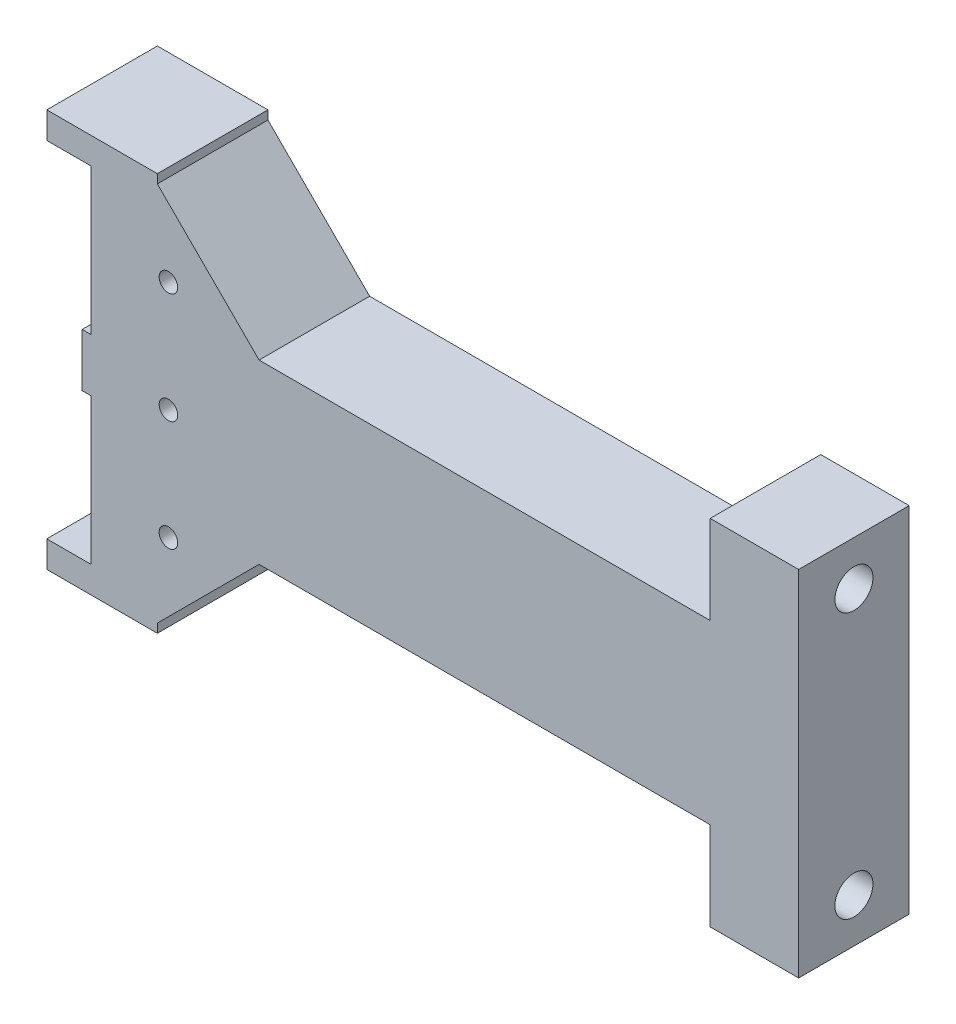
ISO-10303-21;
HEADER;
FILE_DESCRIPTION(('STEP AP214'),'2;1');
FILE_NAME('part.step','',(''),(''),'','','');
FILE_SCHEMA(('AUTOMOTIVE_DESIGN { 1 0 10303 214 1 1 1 1 }'));
ENDSEC;
DATA;
#1=APPLICATION_CONTEXT('core data for automotive mechanical design processes');
#2=APPLICATION_PROTOCOL_DEFINITION('international standard','automotive_design',2000,#1);
#3=PRODUCT_CONTEXT('',#1,'mechanical');
#4=PRODUCT('Part','Part','',(#3));
#5=PRODUCT_RELATED_PRODUCT_CATEGORY('part','',(#4));
#6=PRODUCT_DEFINITION_FORMATION('','',#4);
#7=PRODUCT_DEFINITION_CONTEXT('part definition',#1,'design');
#8=PRODUCT_DEFINITION('design','',#6,#7);
#9=PRODUCT_DEFINITION_SHAPE('','',#8);
#10=(LENGTH_UNIT() NAMED_UNIT(*) SI_UNIT(.MILLI.,.METRE.));
#11=(NAMED_UNIT(*) PLANE_ANGLE_UNIT() SI_UNIT($,.RADIAN.));
#12=(NAMED_UNIT(*) SI_UNIT($,.STERADIAN.) SOLID_ANGLE_UNIT());
#13=UNCERTAINTY_MEASURE_WITH_UNIT(LENGTH_MEASURE(1.E-05),#10,'distance_accuracy_value','');
#14=(GEOMETRIC_REPRESENTATION_CONTEXT(3) GLOBAL_UNCERTAINTY_ASSIGNED_CONTEXT((#13)) GLOBAL_UNIT_ASSIGNED_CONTEXT((#10,
#11,#12)) REPRESENTATION_CONTEXT('',''));
#15=CARTESIAN_POINT('',(0.,0.,0.));
#16=DIRECTION('',(0.,0.,1.));
#17=DIRECTION('',(1.,0.,0.));
#18=AXIS2_PLACEMENT_3D('',#15,#16,#17);
#19=CARTESIAN_POINT('',(-148.,296.054588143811,0.));
#20=DIRECTION('',(1.,0.,0.));
#21=DIRECTION('',(0.,0.,-1.));
#22=AXIS2_PLACEMENT_3D('',#19,#20,#21);
#23=PLANE('',#22);
#24=CARTESIAN_POINT('',(-148.,277.054588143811,19.));
#25=DIRECTION('',(-1.,0.,0.));
#26=DIRECTION('',(0.,0.,1.));
#27=AXIS2_PLACEMENT_3D('',#24,#25,#26);
#28=CIRCLE('',#27,2.1);
#29=CARTESIAN_POINT('',(-148.,277.054588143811,21.1));
#30=VERTEX_POINT('',#29);
#31=EDGE_CURVE('E287',#30,#30,#28,.T.);
#32=ORIENTED_EDGE('',*,*,#31,.F.);
#33=EDGE_LOOP('',(#32));
#34=FACE_BOUND('',#33,.T.);
#35=CARTESIAN_POINT('',(-148.,290.054588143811,19.));
#36=DIRECTION('',(-1.,0.,0.));
#37=DIRECTION('',(0.,0.,1.));
#38=AXIS2_PLACEMENT_3D('',#35,#36,#37);
#39=CIRCLE('',#38,2.1);
#40=CARTESIAN_POINT('',(-148.,290.054588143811,21.1));
#41=VERTEX_POINT('',#40);
#42=EDGE_CURVE('E281',#41,#41,#39,.T.);
#43=ORIENTED_EDGE('',*,*,#42,.F.);
#44=EDGE_LOOP('',(#43));
#45=FACE_BOUND('',#44,.T.);
#46=CARTESIAN_POINT('',(-148.,290.054588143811,5.99999999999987));
#47=DIRECTION('',(-1.,0.,0.));
#48=DIRECTION('',(0.,0.,1.));
#49=AXIS2_PLACEMENT_3D('',#46,#47,#48);
#50=CIRCLE('',#49,2.1);
#51=CARTESIAN_POINT('',(-148.,290.054588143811,8.09999999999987));
#52=VERTEX_POINT('',#51);
#53=EDGE_CURVE('E275',#52,#52,#50,.T.);
#54=ORIENTED_EDGE('',*,*,#53,.F.);
#55=EDGE_LOOP('',(#54));
#56=FACE_BOUND('',#55,.T.);
#57=CARTESIAN_POINT('',(-148.,277.054588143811,5.99999999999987));
#58=DIRECTION('',(-1.,0.,0.));
#59=DIRECTION('',(0.,0.,1.));
#60=AXIS2_PLACEMENT_3D('',#57,#58,#59);
#61=CIRCLE('',#60,2.1);
#62=CARTESIAN_POINT('',(-148.,277.054588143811,8.09999999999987));
#63=VERTEX_POINT('',#62);
#64=EDGE_CURVE('E269',#63,#63,#61,.T.);
#65=ORIENTED_EDGE('',*,*,#64,.F.);
#66=EDGE_LOOP('',(#65));
#67=FACE_BOUND('',#66,.T.);
#68=DIRECTION('',(0.,1.,0.));
#69=VECTOR('',#68,1.);
#70=CARTESIAN_POINT('',(-148.,296.054588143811,0.));
#71=LINE('',#70,#69);
#72=CARTESIAN_POINT('',(-148.,263.054588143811,0.));
#73=VERTEX_POINT('',#72);
#74=CARTESIAN_POINT('',(-148.,296.054588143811,0.));
#75=VERTEX_POINT('',#74);
#76=EDGE_CURVE('E31',#73,#75,#71,.T.);
#77=ORIENTED_EDGE('',*,*,#76,.F.);
#78=DIRECTION('',(0.,0.,1.));
#79=VECTOR('',#78,1.);
#80=CARTESIAN_POINT('',(-148.,263.054588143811,0.));
#81=LINE('',#80,#79);
#82=CARTESIAN_POINT('',(-148.,263.054588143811,25.));
#83=VERTEX_POINT('',#82);
#84=EDGE_CURVE('E225',#73,#83,#81,.T.);
#85=ORIENTED_EDGE('',*,*,#84,.T.);
#86=DIRECTION('',(0.,1.,0.));
#87=VECTOR('',#86,1.);
#88=CARTESIAN_POINT('',(-148.,296.054588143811,25.));
#89=LINE('',#88,#87);
#90=CARTESIAN_POINT('',(-148.,296.054588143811,25.));
#91=VERTEX_POINT('',#90);
#92=EDGE_CURVE('E315',#83,#91,#89,.T.);
#93=ORIENTED_EDGE('',*,*,#92,.T.);
#94=DIRECTION('',(0.,0.,1.));
#95=VECTOR('',#94,1.);
#96=CARTESIAN_POINT('',(-148.,296.054588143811,0.));
#97=LINE('',#96,#95);
#98=EDGE_CURVE('E323',#75,#91,#97,.T.);
#99=ORIENTED_EDGE('',*,*,#98,.F.);
#100=EDGE_LOOP('',(#77,#85,#93,#99));
#101=FACE_BOUND('',#100,.T.);
#102=ADVANCED_FACE('F16',(#34,#45,#56,#67,#101),#23,.F.);
#103=CARTESIAN_POINT('',(-158.,302.054588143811,25.));
#104=DIRECTION('',(1.,0.,0.));
#105=DIRECTION('',(0.,0.,-1.));
#106=AXIS2_PLACEMENT_3D('',#103,#104,#105);
#107=PLANE('',#106);
#108=DIRECTION('',(0.,-1.,0.));
#109=VECTOR('',#108,1.);
#110=CARTESIAN_POINT('',(-158.,302.054588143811,0.));
#111=LINE('',#110,#109);
#112=CARTESIAN_POINT('',(-158.,302.054588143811,0.));
#113=VERTEX_POINT('',#112);
#114=CARTESIAN_POINT('',(-158.,296.054588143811,0.));
#115=VERTEX_POINT('',#114);
#116=EDGE_CURVE('E360',#113,#115,#111,.T.);
#117=ORIENTED_EDGE('',*,*,#116,.T.);
#118=DIRECTION('',(0.,0.,1.));
#119=VECTOR('',#118,1.);
#120=CARTESIAN_POINT('',(-158.,296.054588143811,0.));
#121=LINE('',#120,#119);
#122=CARTESIAN_POINT('',(-158.,296.054588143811,25.));
#123=VERTEX_POINT('',#122);
#124=EDGE_CURVE('E319',#115,#123,#121,.T.);
#125=ORIENTED_EDGE('',*,*,#124,.T.);
#126=DIRECTION('',(0.,-1.,0.));
#127=VECTOR('',#126,1.);
#128=CARTESIAN_POINT('',(-158.,302.054588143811,25.));
#129=LINE('',#128,#127);
#130=CARTESIAN_POINT('',(-158.,302.054588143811,25.));
#131=VERTEX_POINT('',#130);
#132=EDGE_CURVE('E329',#131,#123,#129,.T.);
#133=ORIENTED_EDGE('',*,*,#132,.F.);
#134=DIRECTION('',(0.,0.,-1.));
#135=VECTOR('',#134,1.);
#136=CARTESIAN_POINT('',(-158.,302.054588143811,25.));
#137=LINE('',#136,#135);
#138=EDGE_CURVE('E359',#131,#113,#137,.T.);
#139=ORIENTED_EDGE('',*,*,#138,.T.);
#140=EDGE_LOOP('',(#117,#125,#133,#139));
#141=FACE_BOUND('',#140,.T.);
#142=ADVANCED_FACE('F470',(#141),#107,.F.);
#143=CARTESIAN_POINT('',(-158.,218.05458814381,25.));
#144=VERTEX_POINT('',#143);
#145=CARTESIAN_POINT('',(-158.,212.054588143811,25.));
#146=VERTEX_POINT('',#145);
#147=EDGE_CURVE('E333',#144,#146,#129,.T.);
#148=ORIENTED_EDGE('',*,*,#147,.F.);
#149=DIRECTION('',(0.,0.,1.));
#150=VECTOR('',#149,1.);
#151=CARTESIAN_POINT('',(-158.,218.05458814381,0.));
#152=LINE('',#151,#150);
#153=CARTESIAN_POINT('',(-158.,218.05458814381,0.));
#154=VERTEX_POINT('',#153);
#155=EDGE_CURVE('E312',#154,#144,#152,.T.);
#156=ORIENTED_EDGE('',*,*,#155,.F.);
#157=CARTESIAN_POINT('',(-158.,212.054588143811,0.));
#158=VERTEX_POINT('',#157);
#159=EDGE_CURVE('E322',#154,#158,#111,.T.);
#160=ORIENTED_EDGE('',*,*,#159,.T.);
#161=DIRECTION('',(0.,0.,-1.));
#162=VECTOR('',#161,1.);
#163=CARTESIAN_POINT('',(-158.,212.054588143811,25.));
#164=LINE('',#163,#162);
#165=EDGE_CURVE('E11',#146,#158,#164,.T.);
#166=ORIENTED_EDGE('',*,*,#165,.F.);
#167=EDGE_LOOP('',(#148,#156,#160,#166));
#168=FACE_BOUND('',#167,.T.);
#169=ADVANCED_FACE('F18',(#168),#107,.F.);
#170=CARTESIAN_POINT('',(-133.,212.054588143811,25.));
#171=DIRECTION('',(0.,1.,0.));
#172=DIRECTION('',(0.,0.,1.));
#173=AXIS2_PLACEMENT_3D('',#170,#171,#172);
#174=PLANE('',#173);
#175=DIRECTION('',(1.,0.,0.));
#176=VECTOR('',#175,1.);
#177=CARTESIAN_POINT('',(-133.,212.054588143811,0.));
#178=LINE('',#177,#176);
#179=CARTESIAN_POINT('',(-133.,212.054588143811,0.));
#180=VERTEX_POINT('',#179);
#181=EDGE_CURVE('E363',#158,#180,#178,.T.);
#182=ORIENTED_EDGE('',*,*,#181,.T.);
#183=DIRECTION('',(0.,0.,-1.));
#184=VECTOR('',#183,1.);
#185=CARTESIAN_POINT('',(-133.,212.054588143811,25.));
#186=LINE('',#185,#184);
#187=CARTESIAN_POINT('',(-133.,212.054588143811,25.));
#188=VERTEX_POINT('',#187);
#189=EDGE_CURVE('E24',#188,#180,#186,.T.);
#190=ORIENTED_EDGE('',*,*,#189,.F.);
#191=DIRECTION('',(1.,0.,0.));
#192=VECTOR('',#191,1.);
#193=CARTESIAN_POINT('',(-133.,212.054588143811,25.));
#194=LINE('',#193,#192);
#195=EDGE_CURVE('E332',#146,#188,#194,.T.);
#196=ORIENTED_EDGE('',*,*,#195,.F.);
#197=ORIENTED_EDGE('',*,*,#165,.T.);
#198=EDGE_LOOP('',(#182,#190,#196,#197));
#199=FACE_BOUND('',#198,.T.);
#200=ADVANCED_FACE('F452',(#199),#174,.F.);
#201=CARTESIAN_POINT('',(-133.,214.054588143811,25.));
#202=DIRECTION('',(-1.,0.,0.));
#203=DIRECTION('',(0.,0.,1.));
#204=AXIS2_PLACEMENT_3D('',#201,#202,#203);
#205=PLANE('',#204);
#206=DIRECTION('',(0.,1.,0.));
#207=VECTOR('',#206,1.);
#208=CARTESIAN_POINT('',(-133.,214.054588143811,0.));
#209=LINE('',#208,#207);
#210=CARTESIAN_POINT('',(-133.,214.054588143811,0.));
#211=VERTEX_POINT('',#210);
#212=EDGE_CURVE('E365',#180,#211,#209,.T.);
#213=ORIENTED_EDGE('',*,*,#212,.T.);
#214=DIRECTION('',(0.,0.,-1.));
#215=VECTOR('',#214,1.);
#216=CARTESIAN_POINT('',(-133.,214.054588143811,25.));
#217=LINE('',#216,#215);
#218=CARTESIAN_POINT('',(-133.,214.054588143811,25.));
#219=VERTEX_POINT('',#218);
#220=EDGE_CURVE('E421',#219,#211,#217,.T.);
#221=ORIENTED_EDGE('',*,*,#220,.F.);
#222=DIRECTION('',(0.,1.,0.));
#223=VECTOR('',#222,1.);
#224=CARTESIAN_POINT('',(-133.,214.054588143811,25.));
#225=LINE('',#224,#223);
#226=EDGE_CURVE('E335',#188,#219,#225,.T.);
#227=ORIENTED_EDGE('',*,*,#226,.F.);
#228=ORIENTED_EDGE('',*,*,#189,.T.);
#229=EDGE_LOOP('',(#213,#221,#227,#228));
#230=FACE_BOUND('',#229,.T.);
#231=ADVANCED_FACE('F428',(#230),#205,.F.);
#232=CARTESIAN_POINT('',(-110.,237.05458814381,25.));
#233=DIRECTION('',(-0.707106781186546,0.707106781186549,0.));
#234=DIRECTION('',(-0.707106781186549,-0.707106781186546,0.));
#235=AXIS2_PLACEMENT_3D('',#232,#233,#234);
#236=PLANE('',#235);
#237=DIRECTION('',(0.707106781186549,0.707106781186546,0.));
#238=VECTOR('',#237,1.);
#239=CARTESIAN_POINT('',(-110.,237.05458814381,0.));
#240=LINE('',#239,#238);
#241=CARTESIAN_POINT('',(-110.,237.05458814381,0.));
#242=VERTEX_POINT('',#241);
#243=EDGE_CURVE('E367',#211,#242,#240,.T.);
#244=ORIENTED_EDGE('',*,*,#243,.T.);
#245=DIRECTION('',(0.,0.,-1.));
#246=VECTOR('',#245,1.);
#247=CARTESIAN_POINT('',(-110.,237.05458814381,25.));
#248=LINE('',#247,#246);
#249=CARTESIAN_POINT('',(-110.,237.05458814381,25.));
#250=VERTEX_POINT('',#249);
#251=EDGE_CURVE('E418',#250,#242,#248,.T.);
#252=ORIENTED_EDGE('',*,*,#251,.F.);
#253=DIRECTION('',(0.707106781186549,0.707106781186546,0.));
#254=VECTOR('',#253,1.);
#255=CARTESIAN_POINT('',(-110.,237.05458814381,25.));
#256=LINE('',#255,#254);
#257=EDGE_CURVE('E337',#219,#250,#256,.T.);
#258=ORIENTED_EDGE('',*,*,#257,.F.);
#259=ORIENTED_EDGE('',*,*,#220,.T.);
#260=EDGE_LOOP('',(#244,#252,#258,#259));
#261=FACE_BOUND('',#260,.T.);
#262=ADVANCED_FACE('F439',(#261),#236,.F.);
#263=CARTESIAN_POINT('',(-8.,237.05458814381,25.));
#264=DIRECTION('',(0.,1.,0.));
#265=DIRECTION('',(0.,0.,1.));
#266=AXIS2_PLACEMENT_3D('',#263,#264,#265);
#267=PLANE('',#266);
#268=DIRECTION('',(1.,0.,0.));
#269=VECTOR('',#268,1.);
#270=CARTESIAN_POINT('',(-8.,237.05458814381,0.));
#271=LINE('',#270,#269);
#272=CARTESIAN_POINT('',(-8.,237.05458814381,0.));
#273=VERTEX_POINT('',#272);
#274=EDGE_CURVE('E369',#242,#273,#271,.T.);
#275=ORIENTED_EDGE('',*,*,#274,.T.);
#276=DIRECTION('',(0.,0.,-1.));
#277=VECTOR('',#276,1.);
#278=CARTESIAN_POINT('',(-8.,237.05458814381,25.));
#279=LINE('',#278,#277);
#280=CARTESIAN_POINT('',(-8.,237.05458814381,25.));
#281=VERTEX_POINT('',#280);
#282=EDGE_CURVE('E415',#281,#273,#279,.T.);
#283=ORIENTED_EDGE('',*,*,#282,.F.);
#284=DIRECTION('',(1.,0.,0.));
#285=VECTOR('',#284,1.);
#286=CARTESIAN_POINT('',(-8.,237.05458814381,25.));
#287=LINE('',#286,#285);
#288=EDGE_CURVE('E339',#250,#281,#287,.T.);
#289=ORIENTED_EDGE('',*,*,#288,.F.);
#290=ORIENTED_EDGE('',*,*,#251,.T.);
#291=EDGE_LOOP('',(#275,#283,#289,#290));
#292=FACE_BOUND('',#291,.T.);
#293=ADVANCED_FACE('F443',(#292),#267,.F.);
#294=CARTESIAN_POINT('',(-8.,217.05458814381,25.));
#295=DIRECTION('',(1.,0.,0.));
#296=DIRECTION('',(0.,1.,0.));
#297=AXIS2_PLACEMENT_3D('',#294,#295,#296);
#298=PLANE('',#297);
#299=CARTESIAN_POINT('',(-8.,227.05458814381,12.5));
#300=DIRECTION('',(1.,0.,0.));
#301=DIRECTION('',(0.,0.,-1.));
#302=AXIS2_PLACEMENT_3D('',#299,#300,#301);
#303=CIRCLE('',#302,4.3);
#304=CARTESIAN_POINT('',(-8.,227.05458814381,8.2));
#305=VERTEX_POINT('',#304);
#306=EDGE_CURVE('E302',#305,#305,#303,.T.);
#307=ORIENTED_EDGE('',*,*,#306,.T.);
#308=EDGE_LOOP('',(#307));
#309=FACE_BOUND('',#308,.T.);
#310=DIRECTION('',(0.,-1.,0.));
#311=VECTOR('',#310,1.);
#312=CARTESIAN_POINT('',(-8.,217.05458814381,0.));
#313=LINE('',#312,#311);
#314=CARTESIAN_POINT('',(-8.,217.05458814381,0.));
#315=VERTEX_POINT('',#314);
#316=EDGE_CURVE('E371',#273,#315,#313,.T.);
#317=ORIENTED_EDGE('',*,*,#316,.T.);
#318=DIRECTION('',(0.,0.,-1.));
#319=VECTOR('',#318,1.);
#320=CARTESIAN_POINT('',(-8.,217.05458814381,25.));
#321=LINE('',#320,#319);
#322=CARTESIAN_POINT('',(-8.,217.05458814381,25.));
#323=VERTEX_POINT('',#322);
#324=EDGE_CURVE('E412',#323,#315,#321,.T.);
#325=ORIENTED_EDGE('',*,*,#324,.F.);
#326=DIRECTION('',(0.,-1.,0.));
#327=VECTOR('',#326,1.);
#328=CARTESIAN_POINT('',(-8.,217.05458814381,25.));
#329=LINE('',#328,#327);
#330=EDGE_CURVE('E341',#281,#323,#329,.T.);
#331=ORIENTED_EDGE('',*,*,#330,.F.);
#332=ORIENTED_EDGE('',*,*,#282,.T.);
#333=EDGE_LOOP('',(#317,#325,#331,#332));
#334=FACE_BOUND('',#333,.T.);
#335=ADVANCED_FACE('F512',(#309,#334),#298,.F.);
#336=CARTESIAN_POINT('',(12.,217.05458814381,25.));
#337=DIRECTION('',(0.,1.,0.));
#338=DIRECTION('',(0.,0.,1.));
#339=AXIS2_PLACEMENT_3D('',#336,#337,#338);
#340=PLANE('',#339);
#341=DIRECTION('',(1.,0.,0.));
#342=VECTOR('',#341,1.);
#343=CARTESIAN_POINT('',(12.,217.05458814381,0.));
#344=LINE('',#343,#342);
#345=CARTESIAN_POINT('',(12.,217.05458814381,0.));
#346=VERTEX_POINT('',#345);
#347=EDGE_CURVE('E373',#315,#346,#344,.T.);
#348=ORIENTED_EDGE('',*,*,#347,.T.);
#349=DIRECTION('',(0.,0.,-1.));
#350=VECTOR('',#349,1.);
#351=CARTESIAN_POINT('',(12.,217.05458814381,25.));
#352=LINE('',#351,#350);
#353=CARTESIAN_POINT('',(12.,217.05458814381,25.));
#354=VERTEX_POINT('',#353);
#355=EDGE_CURVE('E409',#354,#346,#352,.T.);
#356=ORIENTED_EDGE('',*,*,#355,.F.);
#357=DIRECTION('',(1.,0.,0.));
#358=VECTOR('',#357,1.);
#359=CARTESIAN_POINT('',(12.,217.05458814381,25.));
#360=LINE('',#359,#358);
#361=EDGE_CURVE('E343',#323,#354,#360,.T.);
#362=ORIENTED_EDGE('',*,*,#361,.F.);
#363=ORIENTED_EDGE('',*,*,#324,.T.);
#364=EDGE_LOOP('',(#348,#356,#362,#363));
#365=FACE_BOUND('',#364,.T.);
#366=ADVANCED_FACE('F509',(#365),#340,.F.);
#367=CARTESIAN_POINT('',(12.,217.05458814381,25.));
#368=DIRECTION('',(-1.,0.,0.));
#369=DIRECTION('',(0.,-1.,0.));
#370=AXIS2_PLACEMENT_3D('',#367,#368,#369);
#371=PLANE('',#370);
#372=CARTESIAN_POINT('',(12.,287.054588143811,12.5));
#373=DIRECTION('',(1.,0.,0.));
#374=DIRECTION('',(0.,0.,-1.));
#375=AXIS2_PLACEMENT_3D('',#372,#373,#374);
#376=CIRCLE('',#375,4.3);
#377=CARTESIAN_POINT('',(12.,287.054588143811,8.2));
#378=VERTEX_POINT('',#377);
#379=EDGE_CURVE('E293',#378,#378,#376,.T.);
#380=ORIENTED_EDGE('',*,*,#379,.F.);
#381=EDGE_LOOP('',(#380));
#382=FACE_BOUND('',#381,.T.);
#383=CARTESIAN_POINT('',(12.,227.05458814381,12.5));
#384=DIRECTION('',(1.,0.,0.));
#385=DIRECTION('',(0.,0.,-1.));
#386=AXIS2_PLACEMENT_3D('',#383,#384,#385);
#387=CIRCLE('',#386,4.3);
#388=CARTESIAN_POINT('',(12.,227.05458814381,8.2));
#389=VERTEX_POINT('',#388);
#390=EDGE_CURVE('E299',#389,#389,#387,.T.);
#391=ORIENTED_EDGE('',*,*,#390,.F.);
#392=EDGE_LOOP('',(#391));
#393=FACE_BOUND('',#392,.T.);
#394=DIRECTION('',(0.,1.,0.));
#395=VECTOR('',#394,1.);
#396=CARTESIAN_POINT('',(12.,217.05458814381,0.));
#397=LINE('',#396,#395);
#398=CARTESIAN_POINT('',(12.,297.054588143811,0.));
#399=VERTEX_POINT('',#398);
#400=EDGE_CURVE('E375',#346,#399,#397,.T.);
#401=ORIENTED_EDGE('',*,*,#400,.T.);
#402=DIRECTION('',(0.,0.,-1.));
#403=VECTOR('',#402,1.);
#404=CARTESIAN_POINT('',(12.,297.054588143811,25.));
#405=LINE('',#404,#403);
#406=CARTESIAN_POINT('',(12.,297.054588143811,25.));
#407=VERTEX_POINT('',#406);
#408=EDGE_CURVE('E406',#407,#399,#405,.T.);
#409=ORIENTED_EDGE('',*,*,#408,.F.);
#410=DIRECTION('',(0.,1.,0.));
#411=VECTOR('',#410,1.);
#412=CARTESIAN_POINT('',(12.,217.05458814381,25.));
#413=LINE('',#412,#411);
#414=EDGE_CURVE('E345',#354,#407,#413,.T.);
#415=ORIENTED_EDGE('',*,*,#414,.F.);
#416=ORIENTED_EDGE('',*,*,#355,.T.);
#417=EDGE_LOOP('',(#401,#409,#415,#416));
#418=FACE_BOUND('',#417,.T.);
#419=ADVANCED_FACE('F505',(#382,#393,#418),#371,.F.);
#420=CARTESIAN_POINT('',(12.,297.054588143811,25.));
#421=DIRECTION('',(0.,-1.,0.));
#422=DIRECTION('',(0.,0.,-1.));
#423=AXIS2_PLACEMENT_3D('',#420,#421,#422);
#424=PLANE('',#423);
#425=DIRECTION('',(-1.,0.,0.));
#426=VECTOR('',#425,1.);
#427=CARTESIAN_POINT('',(12.,297.054588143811,0.));
#428=LINE('',#427,#426);
#429=CARTESIAN_POINT('',(-8.,297.054588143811,0.));
#430=VERTEX_POINT('',#429);
#431=EDGE_CURVE('E377',#399,#430,#428,.T.);
#432=ORIENTED_EDGE('',*,*,#431,.T.);
#433=DIRECTION('',(0.,0.,-1.));
#434=VECTOR('',#433,1.);
#435=CARTESIAN_POINT('',(-8.,297.054588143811,25.));
#436=LINE('',#435,#434);
#437=CARTESIAN_POINT('',(-8.,297.054588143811,25.));
#438=VERTEX_POINT('',#437);
#439=EDGE_CURVE('E403',#438,#430,#436,.T.);
#440=ORIENTED_EDGE('',*,*,#439,.F.);
#441=DIRECTION('',(-1.,0.,0.));
#442=VECTOR('',#441,1.);
#443=CARTESIAN_POINT('',(12.,297.054588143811,25.));
#444=LINE('',#443,#442);
#445=EDGE_CURVE('E347',#407,#438,#444,.T.);
#446=ORIENTED_EDGE('',*,*,#445,.F.);
#447=ORIENTED_EDGE('',*,*,#408,.T.);
#448=EDGE_LOOP('',(#432,#440,#446,#447));
#449=FACE_BOUND('',#448,.T.);
#450=ADVANCED_FACE('F501',(#449),#424,.F.);
#451=CARTESIAN_POINT('',(-8.,297.054588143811,25.));
#452=DIRECTION('',(1.,0.,0.));
#453=DIRECTION('',(0.,1.,0.));
#454=AXIS2_PLACEMENT_3D('',#451,#452,#453);
#455=PLANE('',#454);
#456=CARTESIAN_POINT('',(-8.,287.054588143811,12.5));
#457=DIRECTION('',(1.,0.,0.));
#458=DIRECTION('',(0.,0.,-1.));
#459=AXIS2_PLACEMENT_3D('',#456,#457,#458);
#460=CIRCLE('',#459,4.3);
#461=CARTESIAN_POINT('',(-8.,287.054588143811,8.2));
#462=VERTEX_POINT('',#461);
#463=EDGE_CURVE('E296',#462,#462,#460,.T.);
#464=ORIENTED_EDGE('',*,*,#463,.T.);
#465=EDGE_LOOP('',(#464));
#466=FACE_BOUND('',#465,.T.);
#467=DIRECTION('',(0.,-1.,0.));
#468=VECTOR('',#467,1.);
#469=CARTESIAN_POINT('',(-8.,297.054588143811,0.));
#470=LINE('',#469,#468);
#471=CARTESIAN_POINT('',(-8.,277.054588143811,0.));
#472=VERTEX_POINT('',#471);
#473=EDGE_CURVE('E379',#430,#472,#470,.T.);
#474=ORIENTED_EDGE('',*,*,#473,.T.);
#475=DIRECTION('',(0.,0.,-1.));
#476=VECTOR('',#475,1.);
#477=CARTESIAN_POINT('',(-8.,277.054588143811,25.));
#478=LINE('',#477,#476);
#479=CARTESIAN_POINT('',(-8.,277.054588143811,25.));
#480=VERTEX_POINT('',#479);
#481=EDGE_CURVE('E400',#480,#472,#478,.T.);
#482=ORIENTED_EDGE('',*,*,#481,.F.);
#483=DIRECTION('',(0.,-1.,0.));
#484=VECTOR('',#483,1.);
#485=CARTESIAN_POINT('',(-8.,297.054588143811,25.));
#486=LINE('',#485,#484);
#487=EDGE_CURVE('E349',#438,#480,#486,.T.);
#488=ORIENTED_EDGE('',*,*,#487,.F.);
#489=ORIENTED_EDGE('',*,*,#439,.T.);
#490=EDGE_LOOP('',(#474,#482,#488,#489));
#491=FACE_BOUND('',#490,.T.);
#492=ADVANCED_FACE('F496',(#466,#491),#455,.F.);
#493=CARTESIAN_POINT('',(-8.,277.054588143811,25.));
#494=DIRECTION('',(0.,-1.,0.));
#495=DIRECTION('',(0.,0.,-1.));
#496=AXIS2_PLACEMENT_3D('',#493,#494,#495);
#497=PLANE('',#496);
#498=DIRECTION('',(-1.,0.,0.));
#499=VECTOR('',#498,1.);
#500=CARTESIAN_POINT('',(-8.,277.054588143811,0.));
#501=LINE('',#500,#499);
#502=CARTESIAN_POINT('',(-110.,277.054588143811,0.));
#503=VERTEX_POINT('',#502);
#504=EDGE_CURVE('E381',#472,#503,#501,.T.);
#505=ORIENTED_EDGE('',*,*,#504,.T.);
#506=DIRECTION('',(0.,0.,-1.));
#507=VECTOR('',#506,1.);
#508=CARTESIAN_POINT('',(-110.,277.054588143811,25.));
#509=LINE('',#508,#507);
#510=CARTESIAN_POINT('',(-110.,277.054588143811,25.));
#511=VERTEX_POINT('',#510);
#512=EDGE_CURVE('E397',#511,#503,#509,.T.);
#513=ORIENTED_EDGE('',*,*,#512,.F.);
#514=DIRECTION('',(-1.,0.,0.));
#515=VECTOR('',#514,1.);
#516=CARTESIAN_POINT('',(-8.,277.054588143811,25.));
#517=LINE('',#516,#515);
#518=EDGE_CURVE('E351',#480,#511,#517,.T.);
#519=ORIENTED_EDGE('',*,*,#518,.F.);
#520=ORIENTED_EDGE('',*,*,#481,.T.);
#521=EDGE_LOOP('',(#505,#513,#519,#520));
#522=FACE_BOUND('',#521,.T.);
#523=ADVANCED_FACE('F490',(#522),#497,.F.);
#524=CARTESIAN_POINT('',(-110.,277.054588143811,25.));
#525=DIRECTION('',(-0.707106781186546,-0.707106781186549,0.));
#526=DIRECTION('',(0.707106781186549,-0.707106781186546,0.));
#527=AXIS2_PLACEMENT_3D('',#524,#525,#526);
#528=PLANE('',#527);
#529=DIRECTION('',(-0.707106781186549,0.707106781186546,0.));
#530=VECTOR('',#529,1.);
#531=CARTESIAN_POINT('',(-110.,277.054588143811,0.));
#532=LINE('',#531,#530);
#533=CARTESIAN_POINT('',(-133.,300.054588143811,0.));
#534=VERTEX_POINT('',#533);
#535=EDGE_CURVE('E383',#503,#534,#532,.T.);
#536=ORIENTED_EDGE('',*,*,#535,.T.);
#537=DIRECTION('',(0.,0.,-1.));
#538=VECTOR('',#537,1.);
#539=CARTESIAN_POINT('',(-133.,300.054588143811,25.));
#540=LINE('',#539,#538);
#541=CARTESIAN_POINT('',(-133.,300.054588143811,25.));
#542=VERTEX_POINT('',#541);
#543=EDGE_CURVE('E394',#542,#534,#540,.T.);
#544=ORIENTED_EDGE('',*,*,#543,.F.);
#545=DIRECTION('',(-0.707106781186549,0.707106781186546,0.));
#546=VECTOR('',#545,1.);
#547=CARTESIAN_POINT('',(-110.,277.054588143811,25.));
#548=LINE('',#547,#546);
#549=EDGE_CURVE('E353',#511,#542,#548,.T.);
#550=ORIENTED_EDGE('',*,*,#549,.F.);
#551=ORIENTED_EDGE('',*,*,#512,.T.);
#552=EDGE_LOOP('',(#536,#544,#550,#551));
#553=FACE_BOUND('',#552,.T.);
#554=ADVANCED_FACE('F486',(#553),#528,.F.);
#555=CARTESIAN_POINT('',(-133.,300.054588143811,25.));
#556=DIRECTION('',(-1.,0.,0.));
#557=DIRECTION('',(0.,0.,1.));
#558=AXIS2_PLACEMENT_3D('',#555,#556,#557);
#559=PLANE('',#558);
#560=DIRECTION('',(0.,1.,0.));
#561=VECTOR('',#560,1.);
#562=CARTESIAN_POINT('',(-133.,300.054588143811,0.));
#563=LINE('',#562,#561);
#564=CARTESIAN_POINT('',(-133.,302.054588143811,0.));
#565=VERTEX_POINT('',#564);
#566=EDGE_CURVE('E385',#534,#565,#563,.T.);
#567=ORIENTED_EDGE('',*,*,#566,.T.);
#568=DIRECTION('',(0.,0.,-1.));
#569=VECTOR('',#568,1.);
#570=CARTESIAN_POINT('',(-133.,302.054588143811,25.));
#571=LINE('',#570,#569);
#572=CARTESIAN_POINT('',(-133.,302.054588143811,25.));
#573=VERTEX_POINT('',#572);
#574=EDGE_CURVE('E391',#573,#565,#571,.T.);
#575=ORIENTED_EDGE('',*,*,#574,.F.);
#576=DIRECTION('',(0.,1.,0.));
#577=VECTOR('',#576,1.);
#578=CARTESIAN_POINT('',(-133.,300.054588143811,25.));
#579=LINE('',#578,#577);
#580=EDGE_CURVE('E355',#542,#573,#579,.T.);
#581=ORIENTED_EDGE('',*,*,#580,.F.);
#582=ORIENTED_EDGE('',*,*,#543,.T.);
#583=EDGE_LOOP('',(#567,#575,#581,#582));
#584=FACE_BOUND('',#583,.T.);
#585=ADVANCED_FACE('F482',(#584),#559,.F.);
#586=CARTESIAN_POINT('',(-133.,302.054588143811,25.));
#587=DIRECTION('',(0.,-1.,0.));
#588=DIRECTION('',(0.,0.,-1.));
#589=AXIS2_PLACEMENT_3D('',#586,#587,#588);
#590=PLANE('',#589);
#591=DIRECTION('',(-1.,0.,0.));
#592=VECTOR('',#591,1.);
#593=CARTESIAN_POINT('',(-133.,302.054588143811,0.));
#594=LINE('',#593,#592);
#595=EDGE_CURVE('E387',#565,#113,#594,.T.);
#596=ORIENTED_EDGE('',*,*,#595,.T.);
#597=ORIENTED_EDGE('',*,*,#138,.F.);
#598=DIRECTION('',(-1.,0.,0.));
#599=VECTOR('',#598,1.);
#600=CARTESIAN_POINT('',(-133.,302.054588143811,25.));
#601=LINE('',#600,#599);
#602=EDGE_CURVE('E357',#573,#131,#601,.T.);
#603=ORIENTED_EDGE('',*,*,#602,.F.);
#604=ORIENTED_EDGE('',*,*,#574,.T.);
#605=EDGE_LOOP('',(#596,#597,#603,#604));
#606=FACE_BOUND('',#605,.T.);
#607=ADVANCED_FACE('F476',(#606),#590,.F.);
#608=CARTESIAN_POINT('',(0.,0.,25.));
#609=DIRECTION('',(0.,0.,-1.));
#610=DIRECTION('',(-1.,0.,0.));
#611=AXIS2_PLACEMENT_3D('',#608,#609,#610);
#612=PLANE('',#611);
#613=CARTESIAN_POINT('',(-130.5,282.054588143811,25.));
#614=DIRECTION('',(0.,0.,-1.));
#615=DIRECTION('',(-1.,0.,0.));
#616=AXIS2_PLACEMENT_3D('',#613,#614,#615);
#617=CIRCLE('',#616,2.1);
#618=CARTESIAN_POINT('',(-132.6,282.054588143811,25.));
#619=VERTEX_POINT('',#618);
#620=EDGE_CURVE('E230',#619,#619,#617,.T.);
#621=ORIENTED_EDGE('',*,*,#620,.T.);
#622=EDGE_LOOP('',(#621));
#623=FACE_BOUND('',#622,.T.);
#624=CARTESIAN_POINT('',(-130.5,257.054588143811,25.));
#625=DIRECTION('',(0.,0.,-1.));
#626=DIRECTION('',(-1.,0.,0.));
#627=AXIS2_PLACEMENT_3D('',#624,#625,#626);
#628=CIRCLE('',#627,2.1);
#629=CARTESIAN_POINT('',(-132.6,257.054588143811,25.));
#630=VERTEX_POINT('',#629);
#631=EDGE_CURVE('E236',#630,#630,#628,.T.);
#632=ORIENTED_EDGE('',*,*,#631,.T.);
#633=EDGE_LOOP('',(#632));
#634=FACE_BOUND('',#633,.T.);
#635=CARTESIAN_POINT('',(-130.5,232.05458814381,25.));
#636=DIRECTION('',(0.,0.,-1.));
#637=DIRECTION('',(-1.,0.,0.));
#638=AXIS2_PLACEMENT_3D('',#635,#636,#637);
#639=CIRCLE('',#638,2.1);
#640=CARTESIAN_POINT('',(-132.6,232.05458814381,25.));
#641=VERTEX_POINT('',#640);
#642=EDGE_CURVE('E242',#641,#641,#639,.T.);
#643=ORIENTED_EDGE('',*,*,#642,.T.);
#644=EDGE_LOOP('',(#643));
#645=FACE_BOUND('',#644,.T.);
#646=ORIENTED_EDGE('',*,*,#132,.T.);
#647=DIRECTION('',(-1.,0.,0.));
#648=VECTOR('',#647,1.);
#649=CARTESIAN_POINT('',(-158.,296.054588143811,25.));
#650=LINE('',#649,#648);
#651=EDGE_CURVE('E308',#91,#123,#650,.T.);
#652=ORIENTED_EDGE('',*,*,#651,.F.);
#653=ORIENTED_EDGE('',*,*,#92,.F.);
#654=DIRECTION('',(-1.,0.,0.));
#655=VECTOR('',#654,1.);
#656=CARTESIAN_POINT('',(-150.,263.054588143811,25.));
#657=LINE('',#656,#655);
#658=CARTESIAN_POINT('',(-150.,263.054588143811,25.));
#659=VERTEX_POINT('',#658);
#660=EDGE_CURVE('E214',#83,#659,#657,.T.);
#661=ORIENTED_EDGE('',*,*,#660,.T.);
#662=DIRECTION('',(0.,-1.,0.));
#663=VECTOR('',#662,1.);
#664=CARTESIAN_POINT('',(-150.,263.054588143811,25.));
#665=LINE('',#664,#663);
#666=CARTESIAN_POINT('',(-150.,251.054588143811,25.));
#667=VERTEX_POINT('',#666);
#668=EDGE_CURVE('E220',#659,#667,#665,.T.);
#669=ORIENTED_EDGE('',*,*,#668,.T.);
#670=DIRECTION('',(1.,0.,0.));
#671=VECTOR('',#670,1.);
#672=CARTESIAN_POINT('',(-150.,251.054588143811,25.));
#673=LINE('',#672,#671);
#674=CARTESIAN_POINT('',(-148.,251.054588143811,25.));
#675=VERTEX_POINT('',#674);
#676=EDGE_CURVE('E195',#667,#675,#673,.T.);
#677=ORIENTED_EDGE('',*,*,#676,.T.);
#678=CARTESIAN_POINT('',(-148.,218.05458814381,25.));
#679=VERTEX_POINT('',#678);
#680=EDGE_CURVE('E316',#679,#675,#89,.T.);
#681=ORIENTED_EDGE('',*,*,#680,.F.);
#682=DIRECTION('',(1.,0.,0.));
#683=VECTOR('',#682,1.);
#684=CARTESIAN_POINT('',(-158.,218.05458814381,25.));
#685=LINE('',#684,#683);
#686=EDGE_CURVE('E305',#144,#679,#685,.T.);
#687=ORIENTED_EDGE('',*,*,#686,.F.);
#688=ORIENTED_EDGE('',*,*,#147,.T.);
#689=ORIENTED_EDGE('',*,*,#195,.T.);
#690=ORIENTED_EDGE('',*,*,#226,.T.);
#691=ORIENTED_EDGE('',*,*,#257,.T.);
#692=ORIENTED_EDGE('',*,*,#288,.T.);
#693=ORIENTED_EDGE('',*,*,#330,.T.);
#694=ORIENTED_EDGE('',*,*,#361,.T.);
#695=ORIENTED_EDGE('',*,*,#414,.T.);
#696=ORIENTED_EDGE('',*,*,#445,.T.);
#697=ORIENTED_EDGE('',*,*,#487,.T.);
#698=ORIENTED_EDGE('',*,*,#518,.T.);
#699=ORIENTED_EDGE('',*,*,#549,.T.);
#700=ORIENTED_EDGE('',*,*,#580,.T.);
#701=ORIENTED_EDGE('',*,*,#602,.T.);
#702=EDGE_LOOP('',(#646,#652,#653,#661,#669,#677,#681,#687,#688,#689,#690,#691,#692,#693,#694,
#695,#696,#697,#698,#699,#700,#701));
#703=FACE_BOUND('',#702,.T.);
#704=ADVANCED_FACE('F447',(#623,#634,#645,#703),#612,.F.);
#705=CARTESIAN_POINT('',(0.,0.,0.));
#706=DIRECTION('',(0.,0.,-1.));
#707=DIRECTION('',(-1.,0.,0.));
#708=AXIS2_PLACEMENT_3D('',#705,#706,#707);
#709=PLANE('',#708);
#710=CARTESIAN_POINT('',(-130.5,282.054588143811,0.));
#711=DIRECTION('',(0.,0.,-1.));
#712=DIRECTION('',(-1.,0.,0.));
#713=AXIS2_PLACEMENT_3D('',#710,#711,#712);
#714=CIRCLE('',#713,2.1);
#715=CARTESIAN_POINT('',(-132.6,282.054588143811,0.));
#716=VERTEX_POINT('',#715);
#717=EDGE_CURVE('E224',#716,#716,#714,.T.);
#718=ORIENTED_EDGE('',*,*,#717,.F.);
#719=EDGE_LOOP('',(#718));
#720=FACE_BOUND('',#719,.T.);
#721=CARTESIAN_POINT('',(-130.5,257.054588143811,0.));
#722=DIRECTION('',(0.,0.,-1.));
#723=DIRECTION('',(-1.,0.,0.));
#724=AXIS2_PLACEMENT_3D('',#721,#722,#723);
#725=CIRCLE('',#724,2.1);
#726=CARTESIAN_POINT('',(-132.6,257.054588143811,0.));
#727=VERTEX_POINT('',#726);
#728=EDGE_CURVE('E233',#727,#727,#725,.T.);
#729=ORIENTED_EDGE('',*,*,#728,.F.);
#730=EDGE_LOOP('',(#729));
#731=FACE_BOUND('',#730,.T.);
#732=CARTESIAN_POINT('',(-130.5,232.05458814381,0.));
#733=DIRECTION('',(0.,0.,-1.));
#734=DIRECTION('',(-1.,0.,0.));
#735=AXIS2_PLACEMENT_3D('',#732,#733,#734);
#736=CIRCLE('',#735,2.1);
#737=CARTESIAN_POINT('',(-132.6,232.05458814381,0.));
#738=VERTEX_POINT('',#737);
#739=EDGE_CURVE('E239',#738,#738,#736,.T.);
#740=ORIENTED_EDGE('',*,*,#739,.F.);
#741=EDGE_LOOP('',(#740));
#742=FACE_BOUND('',#741,.T.);
#743=DIRECTION('',(-1.,0.,0.));
#744=VECTOR('',#743,1.);
#745=CARTESIAN_POINT('',(-158.,296.054588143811,0.));
#746=LINE('',#745,#744);
#747=EDGE_CURVE('E310',#75,#115,#746,.T.);
#748=ORIENTED_EDGE('',*,*,#747,.T.);
#749=ORIENTED_EDGE('',*,*,#116,.F.);
#750=ORIENTED_EDGE('',*,*,#595,.F.);
#751=ORIENTED_EDGE('',*,*,#566,.F.);
#752=ORIENTED_EDGE('',*,*,#535,.F.);
#753=ORIENTED_EDGE('',*,*,#504,.F.);
#754=ORIENTED_EDGE('',*,*,#473,.F.);
#755=ORIENTED_EDGE('',*,*,#431,.F.);
#756=ORIENTED_EDGE('',*,*,#400,.F.);
#757=ORIENTED_EDGE('',*,*,#347,.F.);
#758=ORIENTED_EDGE('',*,*,#316,.F.);
#759=ORIENTED_EDGE('',*,*,#274,.F.);
#760=ORIENTED_EDGE('',*,*,#243,.F.);
#761=ORIENTED_EDGE('',*,*,#212,.F.);
#762=ORIENTED_EDGE('',*,*,#181,.F.);
#763=ORIENTED_EDGE('',*,*,#159,.F.);
#764=DIRECTION('',(1.,0.,0.));
#765=VECTOR('',#764,1.);
#766=CARTESIAN_POINT('',(-158.,218.05458814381,0.));
#767=LINE('',#766,#765);
#768=CARTESIAN_POINT('',(-148.,218.05458814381,0.));
#769=VERTEX_POINT('',#768);
#770=EDGE_CURVE('E306',#154,#769,#767,.T.);
#771=ORIENTED_EDGE('',*,*,#770,.T.);
#772=CARTESIAN_POINT('',(-148.,251.054588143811,0.));
#773=VERTEX_POINT('',#772);
#774=EDGE_CURVE('E210',#769,#773,#71,.T.);
#775=ORIENTED_EDGE('',*,*,#774,.T.);
#776=DIRECTION('',(1.,0.,0.));
#777=VECTOR('',#776,1.);
#778=CARTESIAN_POINT('',(-150.,251.054588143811,0.));
#779=LINE('',#778,#777);
#780=CARTESIAN_POINT('',(-150.,251.054588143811,0.));
#781=VERTEX_POINT('',#780);
#782=EDGE_CURVE('E193',#781,#773,#779,.T.);
#783=ORIENTED_EDGE('',*,*,#782,.F.);
#784=DIRECTION('',(0.,-1.,0.));
#785=VECTOR('',#784,1.);
#786=CARTESIAN_POINT('',(-150.,263.054588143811,0.));
#787=LINE('',#786,#785);
#788=CARTESIAN_POINT('',(-150.,263.054588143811,0.));
#789=VERTEX_POINT('',#788);
#790=EDGE_CURVE('E207',#789,#781,#787,.T.);
#791=ORIENTED_EDGE('',*,*,#790,.F.);
#792=DIRECTION('',(-1.,0.,0.));
#793=VECTOR('',#792,1.);
#794=CARTESIAN_POINT('',(-150.,263.054588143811,0.));
#795=LINE('',#794,#793);
#796=EDGE_CURVE('E200',#73,#789,#795,.T.);
#797=ORIENTED_EDGE('',*,*,#796,.F.);
#798=ORIENTED_EDGE('',*,*,#76,.T.);
#799=EDGE_LOOP('',(#748,#749,#750,#751,#752,#753,#754,#755,#756,#757,#758,#759,#760,#761,#762,
#763,#771,#775,#783,#791,#797,#798));
#800=FACE_BOUND('',#799,.T.);
#801=ADVANCED_FACE('F205',(#720,#731,#742,#800),#709,.T.);
#802=CARTESIAN_POINT('',(-158.,296.054588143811,0.));
#803=DIRECTION('',(0.,1.,0.));
#804=DIRECTION('',(0.,0.,1.));
#805=AXIS2_PLACEMENT_3D('',#802,#803,#804);
#806=PLANE('',#805);
#807=ORIENTED_EDGE('',*,*,#651,.T.);
#808=ORIENTED_EDGE('',*,*,#124,.F.);
#809=ORIENTED_EDGE('',*,*,#747,.F.);
#810=ORIENTED_EDGE('',*,*,#98,.T.);
#811=EDGE_LOOP('',(#807,#808,#809,#810));
#812=FACE_BOUND('',#811,.T.);
#813=ADVANCED_FACE('F467',(#812),#806,.F.);
#814=CARTESIAN_POINT('',(-148.,224.05458814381,6.));
#815=DIRECTION('',(-1.,0.,0.));
#816=DIRECTION('',(0.,0.,1.));
#817=AXIS2_PLACEMENT_3D('',#814,#815,#816);
#818=CIRCLE('',#817,2.1);
#819=CARTESIAN_POINT('',(-148.,224.05458814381,8.1));
#820=VERTEX_POINT('',#819);
#821=EDGE_CURVE('E245',#820,#820,#818,.T.);
#822=ORIENTED_EDGE('',*,*,#821,.F.);
#823=EDGE_LOOP('',(#822));
#824=FACE_BOUND('',#823,.T.);
#825=CARTESIAN_POINT('',(-148.,237.05458814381,19.));
#826=DIRECTION('',(-1.,0.,0.));
#827=DIRECTION('',(0.,0.,1.));
#828=AXIS2_PLACEMENT_3D('',#825,#826,#827);
#829=CIRCLE('',#828,2.1);
#830=CARTESIAN_POINT('',(-148.,237.05458814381,21.1));
#831=VERTEX_POINT('',#830);
#832=EDGE_CURVE('E251',#831,#831,#829,.T.);
#833=ORIENTED_EDGE('',*,*,#832,.F.);
#834=EDGE_LOOP('',(#833));
#835=FACE_BOUND('',#834,.T.);
#836=CARTESIAN_POINT('',(-148.,224.05458814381,19.));
#837=DIRECTION('',(-1.,0.,0.));
#838=DIRECTION('',(0.,0.,1.));
#839=AXIS2_PLACEMENT_3D('',#836,#837,#838);
#840=CIRCLE('',#839,2.1);
#841=CARTESIAN_POINT('',(-148.,224.05458814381,21.1));
#842=VERTEX_POINT('',#841);
#843=EDGE_CURVE('E257',#842,#842,#840,.T.);
#844=ORIENTED_EDGE('',*,*,#843,.F.);
#845=EDGE_LOOP('',(#844));
#846=FACE_BOUND('',#845,.T.);
#847=CARTESIAN_POINT('',(-148.,237.05458814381,6.));
#848=DIRECTION('',(-1.,0.,0.));
#849=DIRECTION('',(0.,0.,1.));
#850=AXIS2_PLACEMENT_3D('',#847,#848,#849);
#851=CIRCLE('',#850,2.1);
#852=CARTESIAN_POINT('',(-148.,237.05458814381,8.1));
#853=VERTEX_POINT('',#852);
#854=EDGE_CURVE('E263',#853,#853,#851,.T.);
#855=ORIENTED_EDGE('',*,*,#854,.F.);
#856=EDGE_LOOP('',(#855));
#857=FACE_BOUND('',#856,.T.);
#858=ORIENTED_EDGE('',*,*,#680,.T.);
#859=DIRECTION('',(0.,0.,1.));
#860=VECTOR('',#859,1.);
#861=CARTESIAN_POINT('',(-148.,251.054588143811,0.));
#862=LINE('',#861,#860);
#863=EDGE_CURVE('E39',#773,#675,#862,.T.);
#864=ORIENTED_EDGE('',*,*,#863,.F.);
#865=ORIENTED_EDGE('',*,*,#774,.F.);
#866=DIRECTION('',(0.,0.,1.));
#867=VECTOR('',#866,1.);
#868=CARTESIAN_POINT('',(-148.,218.05458814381,0.));
#869=LINE('',#868,#867);
#870=EDGE_CURVE('E326',#769,#679,#869,.T.);
#871=ORIENTED_EDGE('',*,*,#870,.T.);
#872=EDGE_LOOP('',(#858,#864,#865,#871));
#873=FACE_BOUND('',#872,.T.);
#874=ADVANCED_FACE('F459',(#824,#835,#846,#857,#873),#23,.F.);
#875=CARTESIAN_POINT('',(-158.,218.05458814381,0.));
#876=DIRECTION('',(0.,-1.,0.));
#877=DIRECTION('',(0.,0.,-1.));
#878=AXIS2_PLACEMENT_3D('',#875,#876,#877);
#879=PLANE('',#878);
#880=ORIENTED_EDGE('',*,*,#686,.T.);
#881=ORIENTED_EDGE('',*,*,#870,.F.);
#882=ORIENTED_EDGE('',*,*,#770,.F.);
#883=ORIENTED_EDGE('',*,*,#155,.T.);
#884=EDGE_LOOP('',(#880,#881,#882,#883));
#885=FACE_BOUND('',#884,.T.);
#886=ADVANCED_FACE('F457',(#885),#879,.F.);
#887=CARTESIAN_POINT('',(12.,227.05458814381,12.5));
#888=DIRECTION('',(1.,0.,0.));
#889=DIRECTION('',(0.,0.,-1.));
#890=AXIS2_PLACEMENT_3D('',#887,#888,#889);
#891=CYLINDRICAL_SURFACE('',#890,4.3);
#892=ORIENTED_EDGE('',*,*,#306,.F.);
#893=EDGE_LOOP('',(#892));
#894=FACE_BOUND('',#893,.T.);
#895=ORIENTED_EDGE('',*,*,#390,.T.);
#896=EDGE_LOOP('',(#895));
#897=FACE_BOUND('',#896,.T.);
#898=ADVANCED_FACE('F542',(#894,#897),#891,.F.);
#899=CARTESIAN_POINT('',(12.,287.054588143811,12.5));
#900=DIRECTION('',(1.,0.,0.));
#901=DIRECTION('',(0.,0.,-1.));
#902=AXIS2_PLACEMENT_3D('',#899,#900,#901);
#903=CYLINDRICAL_SURFACE('',#902,4.3);
#904=ORIENTED_EDGE('',*,*,#463,.F.);
#905=EDGE_LOOP('',(#904));
#906=FACE_BOUND('',#905,.T.);
#907=ORIENTED_EDGE('',*,*,#379,.T.);
#908=EDGE_LOOP('',(#907));
#909=FACE_BOUND('',#908,.T.);
#910=ADVANCED_FACE('F601',(#906,#909),#903,.F.);
#911=CARTESIAN_POINT('',(-132.,277.054588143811,19.));
#912=DIRECTION('',(-1.,0.,0.));
#913=DIRECTION('',(0.,0.,1.));
#914=AXIS2_PLACEMENT_3D('',#911,#912,#913);
#915=CONICAL_SURFACE('',#914,2.1,1.02974425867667);
#916=CARTESIAN_POINT('',(-130.738192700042,277.054588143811,19.));
#917=VERTEX_POINT('',#916);
#918=VERTEX_LOOP('',#917);
#919=FACE_BOUND('',#918,.T.);
#920=CARTESIAN_POINT('',(-132.,277.054588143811,19.));
#921=DIRECTION('',(-1.,0.,0.));
#922=DIRECTION('',(0.,0.,1.));
#923=AXIS2_PLACEMENT_3D('',#920,#921,#922);
#924=CIRCLE('',#923,2.1);
#925=CARTESIAN_POINT('',(-132.,277.054588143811,21.1));
#926=VERTEX_POINT('',#925);
#927=EDGE_CURVE('E290',#926,#926,#924,.T.);
#928=ORIENTED_EDGE('',*,*,#927,.T.);
#929=EDGE_LOOP('',(#928));
#930=FACE_BOUND('',#929,.T.);
#931=ADVANCED_FACE('F597',(#919,#930),#915,.F.);
#932=CARTESIAN_POINT('',(-148.,277.054588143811,19.));
#933=DIRECTION('',(-1.,0.,0.));
#934=DIRECTION('',(0.,0.,1.));
#935=AXIS2_PLACEMENT_3D('',#932,#933,#934);
#936=CYLINDRICAL_SURFACE('',#935,2.1);
#937=ORIENTED_EDGE('',*,*,#927,.F.);
#938=EDGE_LOOP('',(#937));
#939=FACE_BOUND('',#938,.T.);
#940=ORIENTED_EDGE('',*,*,#31,.T.);
#941=EDGE_LOOP('',(#940));
#942=FACE_BOUND('',#941,.T.);
#943=ADVANCED_FACE('F593',(#939,#942),#936,.F.);
#944=CARTESIAN_POINT('',(-132.,290.054588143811,19.));
#945=DIRECTION('',(-1.,0.,0.));
#946=DIRECTION('',(0.,0.,1.));
#947=AXIS2_PLACEMENT_3D('',#944,#945,#946);
#948=CONICAL_SURFACE('',#947,2.1,1.02974425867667);
#949=CARTESIAN_POINT('',(-130.738192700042,290.054588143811,19.));
#950=VERTEX_POINT('',#949);
#951=VERTEX_LOOP('',#950);
#952=FACE_BOUND('',#951,.T.);
#953=CARTESIAN_POINT('',(-132.,290.054588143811,19.));
#954=DIRECTION('',(-1.,0.,0.));
#955=DIRECTION('',(0.,0.,1.));
#956=AXIS2_PLACEMENT_3D('',#953,#954,#955);
#957=CIRCLE('',#956,2.1);
#958=CARTESIAN_POINT('',(-132.,290.054588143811,21.1));
#959=VERTEX_POINT('',#958);
#960=EDGE_CURVE('E284',#959,#959,#957,.T.);
#961=ORIENTED_EDGE('',*,*,#960,.T.);
#962=EDGE_LOOP('',(#961));
#963=FACE_BOUND('',#962,.T.);
#964=ADVANCED_FACE('F589',(#952,#963),#948,.F.);
#965=CARTESIAN_POINT('',(-148.,290.054588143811,19.));
#966=DIRECTION('',(-1.,0.,0.));
#967=DIRECTION('',(0.,0.,1.));
#968=AXIS2_PLACEMENT_3D('',#965,#966,#967);
#969=CYLINDRICAL_SURFACE('',#968,2.1);
#970=ORIENTED_EDGE('',*,*,#960,.F.);
#971=EDGE_LOOP('',(#970));
#972=FACE_BOUND('',#971,.T.);
#973=ORIENTED_EDGE('',*,*,#42,.T.);
#974=EDGE_LOOP('',(#973));
#975=FACE_BOUND('',#974,.T.);
#976=ADVANCED_FACE('F585',(#972,#975),#969,.F.);
#977=CARTESIAN_POINT('',(-132.,290.054588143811,5.99999999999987));
#978=DIRECTION('',(-1.,0.,0.));
#979=DIRECTION('',(0.,0.,1.));
#980=AXIS2_PLACEMENT_3D('',#977,#978,#979);
#981=CONICAL_SURFACE('',#980,2.1,1.02974425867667);
#982=CARTESIAN_POINT('',(-130.738192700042,290.054588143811,5.99999999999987));
#983=VERTEX_POINT('',#982);
#984=VERTEX_LOOP('',#983);
#985=FACE_BOUND('',#984,.T.);
#986=CARTESIAN_POINT('',(-132.,290.054588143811,5.99999999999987));
#987=DIRECTION('',(-1.,0.,0.));
#988=DIRECTION('',(0.,0.,1.));
#989=AXIS2_PLACEMENT_3D('',#986,#987,#988);
#990=CIRCLE('',#989,2.1);
#991=CARTESIAN_POINT('',(-132.,290.054588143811,8.09999999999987));
#992=VERTEX_POINT('',#991);
#993=EDGE_CURVE('E278',#992,#992,#990,.T.);
#994=ORIENTED_EDGE('',*,*,#993,.T.);
#995=EDGE_LOOP('',(#994));
#996=FACE_BOUND('',#995,.T.);
#997=ADVANCED_FACE('F581',(#985,#996),#981,.F.);
#998=CARTESIAN_POINT('',(-148.,290.054588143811,5.99999999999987));
#999=DIRECTION('',(-1.,0.,0.));
#1000=DIRECTION('',(0.,0.,1.));
#1001=AXIS2_PLACEMENT_3D('',#998,#999,#1000);
#1002=CYLINDRICAL_SURFACE('',#1001,2.1);
#1003=ORIENTED_EDGE('',*,*,#993,.F.);
#1004=EDGE_LOOP('',(#1003));
#1005=FACE_BOUND('',#1004,.T.);
#1006=ORIENTED_EDGE('',*,*,#53,.T.);
#1007=EDGE_LOOP('',(#1006));
#1008=FACE_BOUND('',#1007,.T.);
#1009=ADVANCED_FACE('F577',(#1005,#1008),#1002,.F.);
#1010=CARTESIAN_POINT('',(-132.,277.054588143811,5.99999999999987));
#1011=DIRECTION('',(-1.,0.,0.));
#1012=DIRECTION('',(0.,0.,1.));
#1013=AXIS2_PLACEMENT_3D('',#1010,#1011,#1012);
#1014=CONICAL_SURFACE('',#1013,2.1,1.02974425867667);
#1015=CARTESIAN_POINT('',(-130.738192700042,277.054588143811,5.99999999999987));
#1016=VERTEX_POINT('',#1015);
#1017=VERTEX_LOOP('',#1016);
#1018=FACE_BOUND('',#1017,.T.);
#1019=CARTESIAN_POINT('',(-132.,277.054588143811,5.99999999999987));
#1020=DIRECTION('',(-1.,0.,0.));
#1021=DIRECTION('',(0.,0.,1.));
#1022=AXIS2_PLACEMENT_3D('',#1019,#1020,#1021);
#1023=CIRCLE('',#1022,2.1);
#1024=CARTESIAN_POINT('',(-132.,277.054588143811,8.09999999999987));
#1025=VERTEX_POINT('',#1024);
#1026=EDGE_CURVE('E272',#1025,#1025,#1023,.T.);
#1027=ORIENTED_EDGE('',*,*,#1026,.T.);
#1028=EDGE_LOOP('',(#1027));
#1029=FACE_BOUND('',#1028,.T.);
#1030=ADVANCED_FACE('F573',(#1018,#1029),#1014,.F.);
#1031=CARTESIAN_POINT('',(-148.,277.054588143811,5.99999999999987));
#1032=DIRECTION('',(-1.,0.,0.));
#1033=DIRECTION('',(0.,0.,1.));
#1034=AXIS2_PLACEMENT_3D('',#1031,#1032,#1033);
#1035=CYLINDRICAL_SURFACE('',#1034,2.1);
#1036=ORIENTED_EDGE('',*,*,#1026,.F.);
#1037=EDGE_LOOP('',(#1036));
#1038=FACE_BOUND('',#1037,.T.);
#1039=ORIENTED_EDGE('',*,*,#64,.T.);
#1040=EDGE_LOOP('',(#1039));
#1041=FACE_BOUND('',#1040,.T.);
#1042=ADVANCED_FACE('F565',(#1038,#1041),#1035,.F.);
#1043=CARTESIAN_POINT('',(-132.,237.05458814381,6.));
#1044=DIRECTION('',(-1.,0.,0.));
#1045=DIRECTION('',(0.,0.,1.));
#1046=AXIS2_PLACEMENT_3D('',#1043,#1044,#1045);
#1047=CONICAL_SURFACE('',#1046,2.1,1.02974425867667);
#1048=CARTESIAN_POINT('',(-130.738192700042,237.05458814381,6.));
#1049=VERTEX_POINT('',#1048);
#1050=VERTEX_LOOP('',#1049);
#1051=FACE_BOUND('',#1050,.T.);
#1052=CARTESIAN_POINT('',(-132.,237.05458814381,6.));
#1053=DIRECTION('',(-1.,0.,0.));
#1054=DIRECTION('',(0.,0.,1.));
#1055=AXIS2_PLACEMENT_3D('',#1052,#1053,#1054);
#1056=CIRCLE('',#1055,2.1);
#1057=CARTESIAN_POINT('',(-132.,237.05458814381,8.1));
#1058=VERTEX_POINT('',#1057);
#1059=EDGE_CURVE('E266',#1058,#1058,#1056,.T.);
#1060=ORIENTED_EDGE('',*,*,#1059,.T.);
#1061=EDGE_LOOP('',(#1060));
#1062=FACE_BOUND('',#1061,.T.);
#1063=ADVANCED_FACE('F554',(#1051,#1062),#1047,.F.);
#1064=CARTESIAN_POINT('',(-148.,237.05458814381,6.));
#1065=DIRECTION('',(-1.,0.,0.));
#1066=DIRECTION('',(0.,0.,1.));
#1067=AXIS2_PLACEMENT_3D('',#1064,#1065,#1066);
#1068=CYLINDRICAL_SURFACE('',#1067,2.1);
#1069=ORIENTED_EDGE('',*,*,#1059,.F.);
#1070=EDGE_LOOP('',(#1069));
#1071=FACE_BOUND('',#1070,.T.);
#1072=ORIENTED_EDGE('',*,*,#854,.T.);
#1073=EDGE_LOOP('',(#1072));
#1074=FACE_BOUND('',#1073,.T.);
#1075=ADVANCED_FACE('F551',(#1071,#1074),#1068,.F.);
#1076=CARTESIAN_POINT('',(-132.,224.05458814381,19.));
#1077=DIRECTION('',(-1.,0.,0.));
#1078=DIRECTION('',(0.,0.,1.));
#1079=AXIS2_PLACEMENT_3D('',#1076,#1077,#1078);
#1080=CONICAL_SURFACE('',#1079,2.1,1.02974425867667);
#1081=CARTESIAN_POINT('',(-130.738192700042,224.05458814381,19.));
#1082=VERTEX_POINT('',#1081);
#1083=VERTEX_LOOP('',#1082);
#1084=FACE_BOUND('',#1083,.T.);
#1085=CARTESIAN_POINT('',(-132.,224.05458814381,19.));
#1086=DIRECTION('',(-1.,0.,0.));
#1087=DIRECTION('',(0.,0.,1.));
#1088=AXIS2_PLACEMENT_3D('',#1085,#1086,#1087);
#1089=CIRCLE('',#1088,2.1);
#1090=CARTESIAN_POINT('',(-132.,224.05458814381,21.1));
#1091=VERTEX_POINT('',#1090);
#1092=EDGE_CURVE('E260',#1091,#1091,#1089,.T.);
#1093=ORIENTED_EDGE('',*,*,#1092,.T.);
#1094=EDGE_LOOP('',(#1093));
#1095=FACE_BOUND('',#1094,.T.);
#1096=ADVANCED_FACE('F553',(#1084,#1095),#1080,.F.);
#1097=CARTESIAN_POINT('',(-148.,224.05458814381,19.));
#1098=DIRECTION('',(-1.,0.,0.));
#1099=DIRECTION('',(0.,0.,1.));
#1100=AXIS2_PLACEMENT_3D('',#1097,#1098,#1099);
#1101=CYLINDRICAL_SURFACE('',#1100,2.1);
#1102=ORIENTED_EDGE('',*,*,#1092,.F.);
#1103=EDGE_LOOP('',(#1102));
#1104=FACE_BOUND('',#1103,.T.);
#1105=ORIENTED_EDGE('',*,*,#843,.T.);
#1106=EDGE_LOOP('',(#1105));
#1107=FACE_BOUND('',#1106,.T.);
#1108=ADVANCED_FACE('F562',(#1104,#1107),#1101,.F.);
#1109=CARTESIAN_POINT('',(-132.,237.05458814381,19.));
#1110=DIRECTION('',(-1.,0.,0.));
#1111=DIRECTION('',(0.,0.,1.));
#1112=AXIS2_PLACEMENT_3D('',#1109,#1110,#1111);
#1113=CONICAL_SURFACE('',#1112,2.1,1.02974425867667);
#1114=CARTESIAN_POINT('',(-130.738192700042,237.05458814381,19.));
#1115=VERTEX_POINT('',#1114);
#1116=VERTEX_LOOP('',#1115);
#1117=FACE_BOUND('',#1116,.T.);
#1118=CARTESIAN_POINT('',(-132.,237.05458814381,19.));
#1119=DIRECTION('',(-1.,0.,0.));
#1120=DIRECTION('',(0.,0.,1.));
#1121=AXIS2_PLACEMENT_3D('',#1118,#1119,#1120);
#1122=CIRCLE('',#1121,2.1);
#1123=CARTESIAN_POINT('',(-132.,237.05458814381,21.1));
#1124=VERTEX_POINT('',#1123);
#1125=EDGE_CURVE('E254',#1124,#1124,#1122,.T.);
#1126=ORIENTED_EDGE('',*,*,#1125,.T.);
#1127=EDGE_LOOP('',(#1126));
#1128=FACE_BOUND('',#1127,.T.);
#1129=ADVANCED_FACE('F677',(#1117,#1128),#1113,.F.);
#1130=CARTESIAN_POINT('',(-148.,237.05458814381,19.));
#1131=DIRECTION('',(-1.,0.,0.));
#1132=DIRECTION('',(0.,0.,1.));
#1133=AXIS2_PLACEMENT_3D('',#1130,#1131,#1132);
#1134=CYLINDRICAL_SURFACE('',#1133,2.1);
#1135=ORIENTED_EDGE('',*,*,#1125,.F.);
#1136=EDGE_LOOP('',(#1135));
#1137=FACE_BOUND('',#1136,.T.);
#1138=ORIENTED_EDGE('',*,*,#832,.T.);
#1139=EDGE_LOOP('',(#1138));
#1140=FACE_BOUND('',#1139,.T.);
#1141=ADVANCED_FACE('F673',(#1137,#1140),#1134,.F.);
#1142=CARTESIAN_POINT('',(-132.,224.05458814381,6.));
#1143=DIRECTION('',(-1.,0.,0.));
#1144=DIRECTION('',(0.,0.,1.));
#1145=AXIS2_PLACEMENT_3D('',#1142,#1143,#1144);
#1146=CONICAL_SURFACE('',#1145,2.1,1.02974425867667);
#1147=CARTESIAN_POINT('',(-130.738192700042,224.05458814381,6.));
#1148=VERTEX_POINT('',#1147);
#1149=VERTEX_LOOP('',#1148);
#1150=FACE_BOUND('',#1149,.T.);
#1151=CARTESIAN_POINT('',(-132.,224.05458814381,6.));
#1152=DIRECTION('',(-1.,0.,0.));
#1153=DIRECTION('',(0.,0.,1.));
#1154=AXIS2_PLACEMENT_3D('',#1151,#1152,#1153);
#1155=CIRCLE('',#1154,2.1);
#1156=CARTESIAN_POINT('',(-132.,224.05458814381,8.1));
#1157=VERTEX_POINT('',#1156);
#1158=EDGE_CURVE('E248',#1157,#1157,#1155,.T.);
#1159=ORIENTED_EDGE('',*,*,#1158,.T.);
#1160=EDGE_LOOP('',(#1159));
#1161=FACE_BOUND('',#1160,.T.);
#1162=ADVANCED_FACE('F666',(#1150,#1161),#1146,.F.);
#1163=CARTESIAN_POINT('',(-148.,224.05458814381,6.));
#1164=DIRECTION('',(-1.,0.,0.));
#1165=DIRECTION('',(0.,0.,1.));
#1166=AXIS2_PLACEMENT_3D('',#1163,#1164,#1165);
#1167=CYLINDRICAL_SURFACE('',#1166,2.1);
#1168=ORIENTED_EDGE('',*,*,#1158,.F.);
#1169=EDGE_LOOP('',(#1168));
#1170=FACE_BOUND('',#1169,.T.);
#1171=ORIENTED_EDGE('',*,*,#821,.T.);
#1172=EDGE_LOOP('',(#1171));
#1173=FACE_BOUND('',#1172,.T.);
#1174=ADVANCED_FACE('F654',(#1170,#1173),#1167,.F.);
#1175=CARTESIAN_POINT('',(-130.5,232.05458814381,0.));
#1176=DIRECTION('',(0.,0.,-1.));
#1177=DIRECTION('',(-1.,0.,0.));
#1178=AXIS2_PLACEMENT_3D('',#1175,#1176,#1177);
#1179=CYLINDRICAL_SURFACE('',#1178,2.1);
#1180=ORIENTED_EDGE('',*,*,#642,.F.);
#1181=EDGE_LOOP('',(#1180));
#1182=FACE_BOUND('',#1181,.T.);
#1183=ORIENTED_EDGE('',*,*,#739,.T.);
#1184=EDGE_LOOP('',(#1183));
#1185=FACE_BOUND('',#1184,.T.);
#1186=ADVANCED_FACE('F650',(#1182,#1185),#1179,.F.);
#1187=CARTESIAN_POINT('',(-130.5,257.054588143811,0.));
#1188=DIRECTION('',(0.,0.,-1.));
#1189=DIRECTION('',(-1.,0.,0.));
#1190=AXIS2_PLACEMENT_3D('',#1187,#1188,#1189);
#1191=CYLINDRICAL_SURFACE('',#1190,2.1);
#1192=ORIENTED_EDGE('',*,*,#631,.F.);
#1193=EDGE_LOOP('',(#1192));
#1194=FACE_BOUND('',#1193,.T.);
#1195=ORIENTED_EDGE('',*,*,#728,.T.);
#1196=EDGE_LOOP('',(#1195));
#1197=FACE_BOUND('',#1196,.T.);
#1198=ADVANCED_FACE('F653',(#1194,#1197),#1191,.F.);
#1199=CARTESIAN_POINT('',(-130.5,282.054588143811,0.));
#1200=DIRECTION('',(0.,0.,-1.));
#1201=DIRECTION('',(-1.,0.,0.));
#1202=AXIS2_PLACEMENT_3D('',#1199,#1200,#1201);
#1203=CYLINDRICAL_SURFACE('',#1202,2.1);
#1204=ORIENTED_EDGE('',*,*,#620,.F.);
#1205=EDGE_LOOP('',(#1204));
#1206=FACE_BOUND('',#1205,.T.);
#1207=ORIENTED_EDGE('',*,*,#717,.T.);
#1208=EDGE_LOOP('',(#1207));
#1209=FACE_BOUND('',#1208,.T.);
#1210=ADVANCED_FACE('F663',(#1206,#1209),#1203,.F.);
#1211=CARTESIAN_POINT('',(-150.,263.054588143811,0.));
#1212=DIRECTION('',(-1.,0.,0.));
#1213=DIRECTION('',(0.,0.,1.));
#1214=AXIS2_PLACEMENT_3D('',#1211,#1212,#1213);
#1215=PLANE('',#1214);
#1216=ORIENTED_EDGE('',*,*,#668,.F.);
#1217=DIRECTION('',(0.,0.,1.));
#1218=VECTOR('',#1217,1.);
#1219=CARTESIAN_POINT('',(-150.,263.054588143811,0.));
#1220=LINE('',#1219,#1218);
#1221=EDGE_CURVE('E213',#789,#659,#1220,.T.);
#1222=ORIENTED_EDGE('',*,*,#1221,.F.);
#1223=ORIENTED_EDGE('',*,*,#790,.T.);
#1224=DIRECTION('',(0.,0.,1.));
#1225=VECTOR('',#1224,1.);
#1226=CARTESIAN_POINT('',(-150.,251.054588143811,0.));
#1227=LINE('',#1226,#1225);
#1228=EDGE_CURVE('E190',#781,#667,#1227,.T.);
#1229=ORIENTED_EDGE('',*,*,#1228,.T.);
#1230=EDGE_LOOP('',(#1216,#1222,#1223,#1229));
#1231=FACE_BOUND('',#1230,.T.);
#1232=ADVANCED_FACE('F212',(#1231),#1215,.T.);
#1233=CARTESIAN_POINT('',(-150.,263.054588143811,0.));
#1234=DIRECTION('',(0.,1.,0.));
#1235=DIRECTION('',(0.,0.,1.));
#1236=AXIS2_PLACEMENT_3D('',#1233,#1234,#1235);
#1237=PLANE('',#1236);
#1238=ORIENTED_EDGE('',*,*,#660,.F.);
#1239=ORIENTED_EDGE('',*,*,#84,.F.);
#1240=ORIENTED_EDGE('',*,*,#796,.T.);
#1241=ORIENTED_EDGE('',*,*,#1221,.T.);
#1242=EDGE_LOOP('',(#1238,#1239,#1240,#1241));
#1243=FACE_BOUND('',#1242,.T.);
#1244=ADVANCED_FACE('F463',(#1243),#1237,.T.);
#1245=CARTESIAN_POINT('',(-150.,251.054588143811,0.));
#1246=DIRECTION('',(0.,-1.,0.));
#1247=DIRECTION('',(0.,0.,-1.));
#1248=AXIS2_PLACEMENT_3D('',#1245,#1246,#1247);
#1249=PLANE('',#1248);
#1250=ORIENTED_EDGE('',*,*,#676,.F.);
#1251=ORIENTED_EDGE('',*,*,#1228,.F.);
#1252=ORIENTED_EDGE('',*,*,#782,.T.);
#1253=ORIENTED_EDGE('',*,*,#863,.T.);
#1254=EDGE_LOOP('',(#1250,#1251,#1252,#1253));
#1255=FACE_BOUND('',#1254,.T.);
#1256=ADVANCED_FACE('F192',(#1255),#1249,.T.);
#1257=CLOSED_SHELL('',(#102,#142,#169,#200,#231,#262,#293,#335,#366,#419,#450,#492,#523,#554,
#585,#607,#704,#801,#813,#874,#886,#898,#910,#931,#943,#964,#976,#997,#1009,#1030,#1042,#1063,
#1075,#1096,#1108,#1129,#1141,#1162,#1174,#1186,#1198,#1210,#1232,#1244,#1256));
#1258=MANIFOLD_SOLID_BREP('B1',#1257);
#1259=ADVANCED_BREP_SHAPE_REPRESENTATION('',(#18,#1258),#14);
#1260=SHAPE_DEFINITION_REPRESENTATION(#9,#1259);
ENDSEC;
END-ISO-10303-21;
